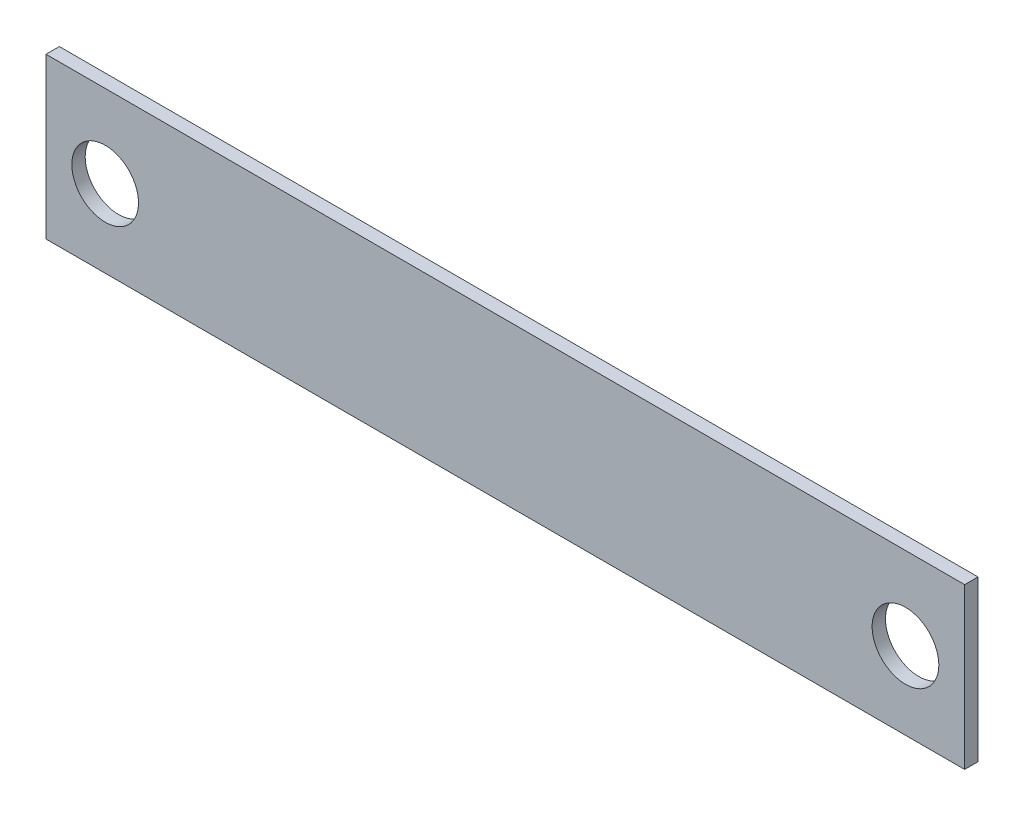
from build123d import *

# Parameters (mm, degrees)
SKETCH1_W           = 3498.85
SKETCH1_H           = 609.6
BOSS_EXTRUDE1_DEPTH = 50.8
SKETCH2_R           = 127
CUT_EXTRUDE1_DEPTH  = 3552.921187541
SKETCH3_R           = 127
CUT_EXTRUDE2_DEPTH  = 3552.921187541


with BuildPart() as part:
    # Sketch1 → Boss-Extrude1 (new body)
    with BuildSketch(Plane.XY):
        with Locations((1749.425, 304.8)):
            Rectangle(SKETCH1_W, SKETCH1_H)
    extrude(amount=BOSS_EXTRUDE1_DEPTH)

    # Sketch2 → Cut-Extrude1 (cut, through all)
    with BuildSketch(Plane(origin=(0, 0, 0), x_dir=(-1, 0, 0), z_dir=(0, 0, -1))):
        with Locations((-225.425, 295.275)):
            Circle(SKETCH2_R)
    extrude(amount=-CUT_EXTRUDE1_DEPTH, mode=Mode.SUBTRACT)

    # Sketch3 → Cut-Extrude2 (cut, through all)
    with BuildSketch(Plane.XY.offset(50.8)):
        with Locations((3273.425, 295.275)):
            Circle(SKETCH3_R)
    extrude(amount=-CUT_EXTRUDE2_DEPTH, mode=Mode.SUBTRACT)


solid = part.part
